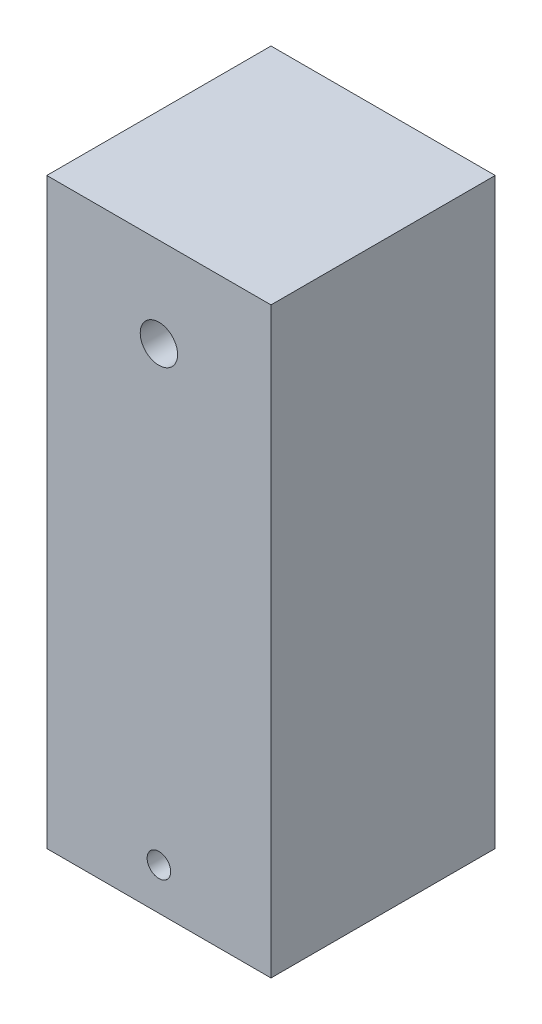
ISO-10303-21;
HEADER;
FILE_DESCRIPTION(('STEP AP214'),'2;1');
FILE_NAME('part.step','',(''),(''),'','','');
FILE_SCHEMA(('AUTOMOTIVE_DESIGN { 1 0 10303 214 1 1 1 1 }'));
ENDSEC;
DATA;
#1=APPLICATION_CONTEXT('core data for automotive mechanical design processes');
#2=APPLICATION_PROTOCOL_DEFINITION('international standard','automotive_design',2000,#1);
#3=PRODUCT_CONTEXT('',#1,'mechanical');
#4=PRODUCT('Part','Part','',(#3));
#5=PRODUCT_RELATED_PRODUCT_CATEGORY('part','',(#4));
#6=PRODUCT_DEFINITION_FORMATION('','',#4);
#7=PRODUCT_DEFINITION_CONTEXT('part definition',#1,'design');
#8=PRODUCT_DEFINITION('design','',#6,#7);
#9=PRODUCT_DEFINITION_SHAPE('','',#8);
#10=(LENGTH_UNIT() NAMED_UNIT(*) SI_UNIT(.MILLI.,.METRE.));
#11=(NAMED_UNIT(*) PLANE_ANGLE_UNIT() SI_UNIT($,.RADIAN.));
#12=(NAMED_UNIT(*) SI_UNIT($,.STERADIAN.) SOLID_ANGLE_UNIT());
#13=UNCERTAINTY_MEASURE_WITH_UNIT(LENGTH_MEASURE(1.E-05),#10,'distance_accuracy_value','');
#14=(GEOMETRIC_REPRESENTATION_CONTEXT(3) GLOBAL_UNCERTAINTY_ASSIGNED_CONTEXT((#13)) GLOBAL_UNIT_ASSIGNED_CONTEXT((#10,
#11,#12)) REPRESENTATION_CONTEXT('',''));
#15=CARTESIAN_POINT('',(0.,0.,0.));
#16=DIRECTION('',(0.,0.,1.));
#17=DIRECTION('',(1.,0.,0.));
#18=AXIS2_PLACEMENT_3D('',#15,#16,#17);
#19=CARTESIAN_POINT('',(0.,0.,19.05));
#20=DIRECTION('',(0.,0.,-1.));
#21=DIRECTION('',(-1.,0.,0.));
#22=AXIS2_PLACEMENT_3D('',#19,#20,#21);
#23=PLANE('',#22);
#24=CARTESIAN_POINT('',(0.,-21.209,19.05));
#25=DIRECTION('',(0.,0.,-1.));
#26=DIRECTION('',(-1.,0.,0.));
#27=AXIS2_PLACEMENT_3D('',#24,#25,#26);
#28=CIRCLE('',#27,1.);
#29=CARTESIAN_POINT('',(-1.,-21.209,19.05));
#30=VERTEX_POINT('',#29);
#31=EDGE_CURVE('E140',#30,#30,#28,.T.);
#32=ORIENTED_EDGE('',*,*,#31,.T.);
#33=EDGE_LOOP('',(#32));
#34=FACE_BOUND('',#33,.T.);
#35=DIRECTION('',(0.,1.,0.));
#36=VECTOR('',#35,1.);
#37=CARTESIAN_POINT('',(9.525,-24.765,19.05));
#38=LINE('',#37,#36);
#39=CARTESIAN_POINT('',(9.525,-24.765,19.05));
#40=VERTEX_POINT('',#39);
#41=CARTESIAN_POINT('',(9.525,24.765,19.05));
#42=VERTEX_POINT('',#41);
#43=EDGE_CURVE('E98',#40,#42,#38,.T.);
#44=ORIENTED_EDGE('',*,*,#43,.T.);
#45=DIRECTION('',(-1.,0.,0.));
#46=VECTOR('',#45,1.);
#47=CARTESIAN_POINT('',(-9.525,24.765,19.05));
#48=LINE('',#47,#46);
#49=CARTESIAN_POINT('',(-9.525,24.765,19.05));
#50=VERTEX_POINT('',#49);
#51=EDGE_CURVE('E93',#42,#50,#48,.T.);
#52=ORIENTED_EDGE('',*,*,#51,.T.);
#53=DIRECTION('',(0.,-1.,0.));
#54=VECTOR('',#53,1.);
#55=CARTESIAN_POINT('',(-9.525,-24.765,19.05));
#56=LINE('',#55,#54);
#57=CARTESIAN_POINT('',(-9.525,-24.765,19.05));
#58=VERTEX_POINT('',#57);
#59=EDGE_CURVE('E96',#50,#58,#56,.T.);
#60=ORIENTED_EDGE('',*,*,#59,.T.);
#61=DIRECTION('',(1.,0.,0.));
#62=VECTOR('',#61,1.);
#63=CARTESIAN_POINT('',(-9.525,-24.765,19.05));
#64=LINE('',#63,#62);
#65=EDGE_CURVE('E63',#58,#40,#64,.T.);
#66=ORIENTED_EDGE('',*,*,#65,.T.);
#67=EDGE_LOOP('',(#44,#52,#60,#66));
#68=FACE_BOUND('',#67,.T.);
#69=CARTESIAN_POINT('',(0.,17.145,19.05));
#70=DIRECTION('',(0.,0.,1.));
#71=DIRECTION('',(1.,0.,0.));
#72=AXIS2_PLACEMENT_3D('',#69,#70,#71);
#73=CIRCLE('',#72,1.5875);
#74=CARTESIAN_POINT('',(-1.5875,17.145,19.05));
#75=VERTEX_POINT('',#74);
#76=EDGE_CURVE('E118',#75,#75,#73,.T.);
#77=ORIENTED_EDGE('',*,*,#76,.F.);
#78=EDGE_LOOP('',(#77));
#79=FACE_BOUND('',#78,.T.);
#80=ADVANCED_FACE('F45',(#34,#68,#79),#23,.F.);
#81=CARTESIAN_POINT('',(0.,0.,0.));
#82=DIRECTION('',(0.,0.,-1.));
#83=DIRECTION('',(-1.,0.,0.));
#84=AXIS2_PLACEMENT_3D('',#81,#82,#83);
#85=PLANE('',#84);
#86=CARTESIAN_POINT('',(0.,-21.209,0.));
#87=DIRECTION('',(0.,0.,-1.));
#88=DIRECTION('',(-1.,0.,0.));
#89=AXIS2_PLACEMENT_3D('',#86,#87,#88);
#90=CIRCLE('',#89,1.);
#91=CARTESIAN_POINT('',(-1.,-21.209,0.));
#92=VERTEX_POINT('',#91);
#93=EDGE_CURVE('E144',#92,#92,#90,.T.);
#94=ORIENTED_EDGE('',*,*,#93,.F.);
#95=EDGE_LOOP('',(#94));
#96=FACE_BOUND('',#95,.T.);
#97=DIRECTION('',(0.,1.,0.));
#98=VECTOR('',#97,1.);
#99=CARTESIAN_POINT('',(9.525,-24.765,0.));
#100=LINE('',#99,#98);
#101=CARTESIAN_POINT('',(9.525,-24.765,0.));
#102=VERTEX_POINT('',#101);
#103=CARTESIAN_POINT('',(9.525,24.765,0.));
#104=VERTEX_POINT('',#103);
#105=EDGE_CURVE('E114',#102,#104,#100,.T.);
#106=ORIENTED_EDGE('',*,*,#105,.F.);
#107=DIRECTION('',(1.,0.,0.));
#108=VECTOR('',#107,1.);
#109=CARTESIAN_POINT('',(-9.525,-24.765,0.));
#110=LINE('',#109,#108);
#111=CARTESIAN_POINT('',(-9.525,-24.765,0.));
#112=VERTEX_POINT('',#111);
#113=EDGE_CURVE('E86',#112,#102,#110,.T.);
#114=ORIENTED_EDGE('',*,*,#113,.F.);
#115=DIRECTION('',(0.,-1.,0.));
#116=VECTOR('',#115,1.);
#117=CARTESIAN_POINT('',(-9.525,-24.765,0.));
#118=LINE('',#117,#116);
#119=CARTESIAN_POINT('',(-9.525,24.765,0.));
#120=VERTEX_POINT('',#119);
#121=EDGE_CURVE('E80',#120,#112,#118,.T.);
#122=ORIENTED_EDGE('',*,*,#121,.F.);
#123=DIRECTION('',(-1.,0.,0.));
#124=VECTOR('',#123,1.);
#125=CARTESIAN_POINT('',(-9.525,24.765,0.));
#126=LINE('',#125,#124);
#127=EDGE_CURVE('E103',#104,#120,#126,.T.);
#128=ORIENTED_EDGE('',*,*,#127,.F.);
#129=EDGE_LOOP('',(#106,#114,#122,#128));
#130=FACE_BOUND('',#129,.T.);
#131=CARTESIAN_POINT('',(0.,17.145,0.));
#132=DIRECTION('',(0.,0.,1.));
#133=DIRECTION('',(1.,0.,0.));
#134=AXIS2_PLACEMENT_3D('',#131,#132,#133);
#135=CIRCLE('',#134,1.5875);
#136=CARTESIAN_POINT('',(-1.5875,17.145,0.));
#137=VERTEX_POINT('',#136);
#138=EDGE_CURVE('E136',#137,#137,#135,.T.);
#139=ORIENTED_EDGE('',*,*,#138,.T.);
#140=EDGE_LOOP('',(#139));
#141=FACE_BOUND('',#140,.T.);
#142=ADVANCED_FACE('F131',(#96,#130,#141),#85,.T.);
#143=CARTESIAN_POINT('',(9.525,-24.765,19.05));
#144=DIRECTION('',(-1.,0.,0.));
#145=DIRECTION('',(0.,0.,1.));
#146=AXIS2_PLACEMENT_3D('',#143,#144,#145);
#147=PLANE('',#146);
#148=ORIENTED_EDGE('',*,*,#105,.T.);
#149=DIRECTION('',(0.,0.,-1.));
#150=VECTOR('',#149,1.);
#151=CARTESIAN_POINT('',(9.525,24.765,19.05));
#152=LINE('',#151,#150);
#153=EDGE_CURVE('E11',#42,#104,#152,.T.);
#154=ORIENTED_EDGE('',*,*,#153,.F.);
#155=ORIENTED_EDGE('',*,*,#43,.F.);
#156=DIRECTION('',(0.,0.,-1.));
#157=VECTOR('',#156,1.);
#158=CARTESIAN_POINT('',(9.525,-24.765,19.05));
#159=LINE('',#158,#157);
#160=EDGE_CURVE('E110',#40,#102,#159,.T.);
#161=ORIENTED_EDGE('',*,*,#160,.T.);
#162=EDGE_LOOP('',(#148,#154,#155,#161));
#163=FACE_BOUND('',#162,.T.);
#164=ADVANCED_FACE('F47',(#163),#147,.F.);
#165=CARTESIAN_POINT('',(-9.525,24.765,19.05));
#166=DIRECTION('',(0.,-1.,0.));
#167=DIRECTION('',(0.,0.,-1.));
#168=AXIS2_PLACEMENT_3D('',#165,#166,#167);
#169=PLANE('',#168);
#170=ORIENTED_EDGE('',*,*,#127,.T.);
#171=DIRECTION('',(0.,0.,-1.));
#172=VECTOR('',#171,1.);
#173=CARTESIAN_POINT('',(-9.525,24.765,19.05));
#174=LINE('',#173,#172);
#175=EDGE_CURVE('E55',#50,#120,#174,.T.);
#176=ORIENTED_EDGE('',*,*,#175,.F.);
#177=ORIENTED_EDGE('',*,*,#51,.F.);
#178=ORIENTED_EDGE('',*,*,#153,.T.);
#179=EDGE_LOOP('',(#170,#176,#177,#178));
#180=FACE_BOUND('',#179,.T.);
#181=ADVANCED_FACE('F102',(#180),#169,.F.);
#182=CARTESIAN_POINT('',(-9.525,-24.765,19.05));
#183=DIRECTION('',(1.,0.,0.));
#184=DIRECTION('',(0.,0.,-1.));
#185=AXIS2_PLACEMENT_3D('',#182,#183,#184);
#186=PLANE('',#185);
#187=ORIENTED_EDGE('',*,*,#121,.T.);
#188=DIRECTION('',(0.,0.,-1.));
#189=VECTOR('',#188,1.);
#190=CARTESIAN_POINT('',(-9.525,-24.765,19.05));
#191=LINE('',#190,#189);
#192=EDGE_CURVE('E105',#58,#112,#191,.T.);
#193=ORIENTED_EDGE('',*,*,#192,.F.);
#194=ORIENTED_EDGE('',*,*,#59,.F.);
#195=ORIENTED_EDGE('',*,*,#175,.T.);
#196=EDGE_LOOP('',(#187,#193,#194,#195));
#197=FACE_BOUND('',#196,.T.);
#198=ADVANCED_FACE('F106',(#197),#186,.F.);
#199=CARTESIAN_POINT('',(-9.525,-24.765,19.05));
#200=DIRECTION('',(0.,1.,0.));
#201=DIRECTION('',(0.,0.,1.));
#202=AXIS2_PLACEMENT_3D('',#199,#200,#201);
#203=PLANE('',#202);
#204=ORIENTED_EDGE('',*,*,#113,.T.);
#205=ORIENTED_EDGE('',*,*,#160,.F.);
#206=ORIENTED_EDGE('',*,*,#65,.F.);
#207=ORIENTED_EDGE('',*,*,#192,.T.);
#208=EDGE_LOOP('',(#204,#205,#206,#207));
#209=FACE_BOUND('',#208,.T.);
#210=ADVANCED_FACE('F128',(#209),#203,.F.);
#211=CARTESIAN_POINT('',(0.,17.145,19.05));
#212=DIRECTION('',(0.,0.,-1.));
#213=DIRECTION('',(-1.,0.,0.));
#214=AXIS2_PLACEMENT_3D('',#211,#212,#213);
#215=CYLINDRICAL_SURFACE('',#214,1.5875);
#216=CARTESIAN_POINT('',(-1.5875,17.145,19.05));
#217=CARTESIAN_POINT('',(-1.5875,17.145,18.8515625));
#218=CARTESIAN_POINT('',(-1.5875,17.145,18.653125));
#219=CARTESIAN_POINT('',(-1.5875,17.145,18.25625));
#220=CARTESIAN_POINT('',(-1.5875,17.145,18.0578125));
#221=CARTESIAN_POINT('',(-1.5875,17.145,17.6609375));
#222=CARTESIAN_POINT('',(-1.5875,17.145,17.4625));
#223=CARTESIAN_POINT('',(-1.5875,17.145,17.065625));
#224=CARTESIAN_POINT('',(-1.5875,17.145,16.8671875));
#225=CARTESIAN_POINT('',(-1.5875,17.145,16.4703125));
#226=CARTESIAN_POINT('',(-1.5875,17.145,16.271875));
#227=CARTESIAN_POINT('',(-1.5875,17.145,15.875));
#228=CARTESIAN_POINT('',(-1.5875,17.145,15.6765625));
#229=CARTESIAN_POINT('',(-1.5875,17.145,15.2796875));
#230=CARTESIAN_POINT('',(-1.5875,17.145,15.08125));
#231=CARTESIAN_POINT('',(-1.5875,17.145,14.684375));
#232=CARTESIAN_POINT('',(-1.5875,17.145,14.4859375));
#233=CARTESIAN_POINT('',(-1.5875,17.145,14.0890625));
#234=CARTESIAN_POINT('',(-1.5875,17.145,13.890625));
#235=CARTESIAN_POINT('',(-1.5875,17.145,13.49375));
#236=CARTESIAN_POINT('',(-1.5875,17.145,13.2953125));
#237=CARTESIAN_POINT('',(-1.5875,17.145,12.8984375));
#238=CARTESIAN_POINT('',(-1.5875,17.145,12.7));
#239=CARTESIAN_POINT('',(-1.5875,17.145,12.303125));
#240=CARTESIAN_POINT('',(-1.5875,17.145,12.1046875));
#241=CARTESIAN_POINT('',(-1.5875,17.145,11.7078125));
#242=CARTESIAN_POINT('',(-1.5875,17.145,11.509375));
#243=CARTESIAN_POINT('',(-1.5875,17.145,11.1125));
#244=CARTESIAN_POINT('',(-1.5875,17.145,10.9140625));
#245=CARTESIAN_POINT('',(-1.5875,17.145,10.5171875));
#246=CARTESIAN_POINT('',(-1.5875,17.145,10.31875));
#247=CARTESIAN_POINT('',(-1.5875,17.145,9.921875));
#248=CARTESIAN_POINT('',(-1.5875,17.145,9.7234375));
#249=CARTESIAN_POINT('',(-1.5875,17.145,9.3265625));
#250=CARTESIAN_POINT('',(-1.5875,17.145,9.128125));
#251=CARTESIAN_POINT('',(-1.5875,17.145,8.73125));
#252=CARTESIAN_POINT('',(-1.5875,17.145,8.5328125));
#253=CARTESIAN_POINT('',(-1.5875,17.145,8.1359375));
#254=CARTESIAN_POINT('',(-1.5875,17.145,7.9375));
#255=CARTESIAN_POINT('',(-1.5875,17.145,7.540625));
#256=CARTESIAN_POINT('',(-1.5875,17.145,7.3421875));
#257=CARTESIAN_POINT('',(-1.5875,17.145,6.9453125));
#258=CARTESIAN_POINT('',(-1.5875,17.145,6.746875));
#259=CARTESIAN_POINT('',(-1.5875,17.145,6.35));
#260=CARTESIAN_POINT('',(-1.5875,17.145,6.1515625));
#261=CARTESIAN_POINT('',(-1.5875,17.145,5.7546875));
#262=CARTESIAN_POINT('',(-1.5875,17.145,5.55625));
#263=CARTESIAN_POINT('',(-1.5875,17.145,5.159375));
#264=CARTESIAN_POINT('',(-1.5875,17.145,4.9609375));
#265=CARTESIAN_POINT('',(-1.5875,17.145,4.5640625));
#266=CARTESIAN_POINT('',(-1.5875,17.145,4.365625));
#267=CARTESIAN_POINT('',(-1.5875,17.145,3.96875));
#268=CARTESIAN_POINT('',(-1.5875,17.145,3.7703125));
#269=CARTESIAN_POINT('',(-1.5875,17.145,3.3734375));
#270=CARTESIAN_POINT('',(-1.5875,17.145,3.175));
#271=CARTESIAN_POINT('',(-1.5875,17.145,2.778125));
#272=CARTESIAN_POINT('',(-1.5875,17.145,2.5796875));
#273=CARTESIAN_POINT('',(-1.5875,17.145,2.1828125));
#274=CARTESIAN_POINT('',(-1.5875,17.145,1.984375));
#275=CARTESIAN_POINT('',(-1.5875,17.145,1.5875));
#276=CARTESIAN_POINT('',(-1.5875,17.145,1.3890625));
#277=CARTESIAN_POINT('',(-1.5875,17.145,0.992187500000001));
#278=CARTESIAN_POINT('',(-1.5875,17.145,0.793750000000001));
#279=CARTESIAN_POINT('',(-1.5875,17.145,0.396875));
#280=CARTESIAN_POINT('',(-1.5875,17.145,0.1984375));
#281=CARTESIAN_POINT('',(-1.5875,17.145,0.));
#282=B_SPLINE_CURVE_WITH_KNOTS('',3,(#216,#217,#218,#219,#220,#221,#222,#223,#224,#225,#226,
#227,#228,#229,#230,#231,#232,#233,#234,#235,#236,#237,#238,#239,#240,#241,#242,#243,#244,#245,
#246,#247,#248,#249,#250,#251,#252,#253,#254,#255,#256,#257,#258,#259,#260,#261,#262,#263,#264,
#265,#266,#267,#268,#269,#270,#271,#272,#273,#274,#275,#276,#277,#278,#279,#280,#281),
.UNSPECIFIED.,.F.,.F.,(4,2,2,2,2,2,2,2,2,2,2,2,2,2,2,2,2,2,2,2,2,2,2,2,2,2,2,2,2,2,2,2,4),(0.,
0.595312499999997,1.190625,1.7859375,2.38125,2.9765625,3.571875,4.1671875,4.7625,5.3578125,
5.953125,6.5484375,7.14375,7.7390625,8.334375,8.9296875,9.525,10.1203125,10.715625,11.3109375,
11.90625,12.5015625,13.096875,13.6921875,14.2875,14.8828125,15.478125,16.0734375,16.66875,
17.2640625,17.859375,18.4546875,19.05),.UNSPECIFIED.);
#283=EDGE_CURVE('BSEAM156',#75,#137,#282,.T.);
#284=ORIENTED_EDGE('',*,*,#76,.T.);
#285=ORIENTED_EDGE('',*,*,#138,.F.);
#286=ORIENTED_EDGE('',*,*,#283,.T.);
#287=ORIENTED_EDGE('',*,*,#283,.F.);
#288=EDGE_LOOP('',(#284,#286,#285,#287));
#289=FACE_BOUND('',#288,.T.);
#290=ADVANCED_FACE('F156',(#289),#215,.F.);
#291=CARTESIAN_POINT('',(0.,-21.209,19.05));
#292=DIRECTION('',(0.,0.,-1.));
#293=DIRECTION('',(-1.,0.,0.));
#294=AXIS2_PLACEMENT_3D('',#291,#292,#293);
#295=CYLINDRICAL_SURFACE('',#294,1.);
#296=CARTESIAN_POINT('',(-1.,-21.209,19.05));
#297=CARTESIAN_POINT('',(-1.,-21.209,18.8515625));
#298=CARTESIAN_POINT('',(-1.,-21.209,18.653125));
#299=CARTESIAN_POINT('',(-1.,-21.209,18.25625));
#300=CARTESIAN_POINT('',(-1.,-21.209,18.0578125));
#301=CARTESIAN_POINT('',(-1.,-21.209,17.6609375));
#302=CARTESIAN_POINT('',(-1.,-21.209,17.4625));
#303=CARTESIAN_POINT('',(-1.,-21.209,17.065625));
#304=CARTESIAN_POINT('',(-1.,-21.209,16.8671875));
#305=CARTESIAN_POINT('',(-1.,-21.209,16.4703125));
#306=CARTESIAN_POINT('',(-1.,-21.209,16.271875));
#307=CARTESIAN_POINT('',(-1.,-21.209,15.875));
#308=CARTESIAN_POINT('',(-1.,-21.209,15.6765625));
#309=CARTESIAN_POINT('',(-1.,-21.209,15.2796875));
#310=CARTESIAN_POINT('',(-1.,-21.209,15.08125));
#311=CARTESIAN_POINT('',(-1.,-21.209,14.684375));
#312=CARTESIAN_POINT('',(-1.,-21.209,14.4859375));
#313=CARTESIAN_POINT('',(-1.,-21.209,14.0890625));
#314=CARTESIAN_POINT('',(-1.,-21.209,13.890625));
#315=CARTESIAN_POINT('',(-1.,-21.209,13.49375));
#316=CARTESIAN_POINT('',(-1.,-21.209,13.2953125));
#317=CARTESIAN_POINT('',(-1.,-21.209,12.8984375));
#318=CARTESIAN_POINT('',(-1.,-21.209,12.7));
#319=CARTESIAN_POINT('',(-1.,-21.209,12.303125));
#320=CARTESIAN_POINT('',(-1.,-21.209,12.1046875));
#321=CARTESIAN_POINT('',(-1.,-21.209,11.7078125));
#322=CARTESIAN_POINT('',(-1.,-21.209,11.509375));
#323=CARTESIAN_POINT('',(-1.,-21.209,11.1125));
#324=CARTESIAN_POINT('',(-1.,-21.209,10.9140625));
#325=CARTESIAN_POINT('',(-1.,-21.209,10.5171875));
#326=CARTESIAN_POINT('',(-1.,-21.209,10.31875));
#327=CARTESIAN_POINT('',(-1.,-21.209,9.921875));
#328=CARTESIAN_POINT('',(-1.,-21.209,9.7234375));
#329=CARTESIAN_POINT('',(-1.,-21.209,9.3265625));
#330=CARTESIAN_POINT('',(-1.,-21.209,9.128125));
#331=CARTESIAN_POINT('',(-1.,-21.209,8.73125));
#332=CARTESIAN_POINT('',(-1.,-21.209,8.5328125));
#333=CARTESIAN_POINT('',(-1.,-21.209,8.1359375));
#334=CARTESIAN_POINT('',(-1.,-21.209,7.9375));
#335=CARTESIAN_POINT('',(-1.,-21.209,7.540625));
#336=CARTESIAN_POINT('',(-1.,-21.209,7.3421875));
#337=CARTESIAN_POINT('',(-1.,-21.209,6.9453125));
#338=CARTESIAN_POINT('',(-1.,-21.209,6.746875));
#339=CARTESIAN_POINT('',(-1.,-21.209,6.35));
#340=CARTESIAN_POINT('',(-1.,-21.209,6.1515625));
#341=CARTESIAN_POINT('',(-1.,-21.209,5.7546875));
#342=CARTESIAN_POINT('',(-1.,-21.209,5.55625));
#343=CARTESIAN_POINT('',(-1.,-21.209,5.159375));
#344=CARTESIAN_POINT('',(-1.,-21.209,4.9609375));
#345=CARTESIAN_POINT('',(-1.,-21.209,4.5640625));
#346=CARTESIAN_POINT('',(-1.,-21.209,4.365625));
#347=CARTESIAN_POINT('',(-1.,-21.209,3.96875));
#348=CARTESIAN_POINT('',(-1.,-21.209,3.7703125));
#349=CARTESIAN_POINT('',(-1.,-21.209,3.3734375));
#350=CARTESIAN_POINT('',(-1.,-21.209,3.175));
#351=CARTESIAN_POINT('',(-1.,-21.209,2.778125));
#352=CARTESIAN_POINT('',(-1.,-21.209,2.5796875));
#353=CARTESIAN_POINT('',(-1.,-21.209,2.1828125));
#354=CARTESIAN_POINT('',(-1.,-21.209,1.984375));
#355=CARTESIAN_POINT('',(-1.,-21.209,1.5875));
#356=CARTESIAN_POINT('',(-1.,-21.209,1.3890625));
#357=CARTESIAN_POINT('',(-1.,-21.209,0.992187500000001));
#358=CARTESIAN_POINT('',(-1.,-21.209,0.793750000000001));
#359=CARTESIAN_POINT('',(-1.,-21.209,0.396875));
#360=CARTESIAN_POINT('',(-1.,-21.209,0.1984375));
#361=CARTESIAN_POINT('',(-1.,-21.209,0.));
#362=B_SPLINE_CURVE_WITH_KNOTS('',3,(#296,#297,#298,#299,#300,#301,#302,#303,#304,#305,#306,
#307,#308,#309,#310,#311,#312,#313,#314,#315,#316,#317,#318,#319,#320,#321,#322,#323,#324,#325,
#326,#327,#328,#329,#330,#331,#332,#333,#334,#335,#336,#337,#338,#339,#340,#341,#342,#343,#344,
#345,#346,#347,#348,#349,#350,#351,#352,#353,#354,#355,#356,#357,#358,#359,#360,#361),
.UNSPECIFIED.,.F.,.F.,(4,2,2,2,2,2,2,2,2,2,2,2,2,2,2,2,2,2,2,2,2,2,2,2,2,2,2,2,2,2,2,2,4),(0.,
0.5953125,1.190625,1.7859375,2.38125,2.9765625,3.571875,4.1671875,4.7625,5.3578125,5.953125,
6.5484375,7.14375,7.7390625,8.334375,8.9296875,9.525,10.1203125,10.715625,11.3109375,11.90625,
12.5015625,13.096875,13.6921875,14.2875,14.8828125,15.478125,16.0734375,16.66875,17.2640625,
17.859375,18.4546875,19.05),.UNSPECIFIED.);
#363=EDGE_CURVE('BSEAM153',#30,#92,#362,.T.);
#364=ORIENTED_EDGE('',*,*,#31,.F.);
#365=ORIENTED_EDGE('',*,*,#93,.T.);
#366=ORIENTED_EDGE('',*,*,#363,.T.);
#367=ORIENTED_EDGE('',*,*,#363,.F.);
#368=EDGE_LOOP('',(#364,#366,#365,#367));
#369=FACE_BOUND('',#368,.T.);
#370=ADVANCED_FACE('F153',(#369),#295,.F.);
#371=CLOSED_SHELL('',(#80,#142,#164,#181,#198,#210,#290,#370));
#372=MANIFOLD_SOLID_BREP('B2',#371);
#373=ADVANCED_BREP_SHAPE_REPRESENTATION('',(#18,#372),#14);
#374=SHAPE_DEFINITION_REPRESENTATION(#9,#373);
ENDSEC;
END-ISO-10303-21;
